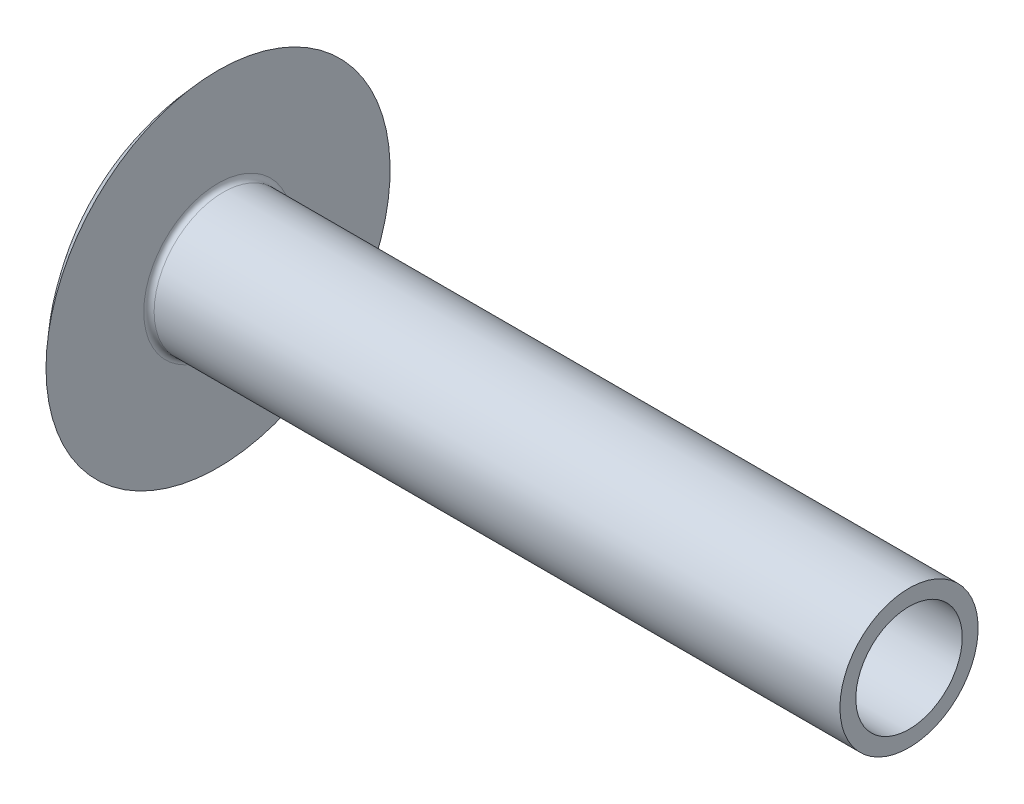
ISO-10303-21;
HEADER;
FILE_DESCRIPTION(('STEP AP214'),'2;1');
FILE_NAME('part.step','',(''),(''),'','','');
FILE_SCHEMA(('AUTOMOTIVE_DESIGN { 1 0 10303 214 1 1 1 1 }'));
ENDSEC;
DATA;
#1=APPLICATION_CONTEXT('core data for automotive mechanical design processes');
#2=APPLICATION_PROTOCOL_DEFINITION('international standard','automotive_design',2000,#1);
#3=PRODUCT_CONTEXT('',#1,'mechanical');
#4=PRODUCT('Part','Part','',(#3));
#5=PRODUCT_RELATED_PRODUCT_CATEGORY('part','',(#4));
#6=PRODUCT_DEFINITION_FORMATION('','',#4);
#7=PRODUCT_DEFINITION_CONTEXT('part definition',#1,'design');
#8=PRODUCT_DEFINITION('design','',#6,#7);
#9=PRODUCT_DEFINITION_SHAPE('','',#8);
#10=(LENGTH_UNIT() NAMED_UNIT(*) SI_UNIT(.MILLI.,.METRE.));
#11=(NAMED_UNIT(*) PLANE_ANGLE_UNIT() SI_UNIT($,.RADIAN.));
#12=(NAMED_UNIT(*) SI_UNIT($,.STERADIAN.) SOLID_ANGLE_UNIT());
#13=UNCERTAINTY_MEASURE_WITH_UNIT(LENGTH_MEASURE(1.E-05),#10,'distance_accuracy_value','');
#14=(GEOMETRIC_REPRESENTATION_CONTEXT(3) GLOBAL_UNCERTAINTY_ASSIGNED_CONTEXT((#13)) GLOBAL_UNIT_ASSIGNED_CONTEXT((#10,
#11,#12)) REPRESENTATION_CONTEXT('',''));
#15=CARTESIAN_POINT('',(0.,0.,0.));
#16=DIRECTION('',(0.,0.,1.));
#17=DIRECTION('',(1.,0.,0.));
#18=AXIS2_PLACEMENT_3D('',#15,#16,#17);
#19=CARTESIAN_POINT('',(43.9620495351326,0.,0.));
#20=DIRECTION('',(-1.,0.,0.));
#21=DIRECTION('',(0.,0.,1.));
#22=AXIS2_PLACEMENT_3D('',#19,#20,#21);
#23=PLANE('',#22);
#24=CARTESIAN_POINT('',(43.9620495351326,0.,0.));
#25=DIRECTION('',(1.,0.,0.));
#26=DIRECTION('',(0.,0.,-1.));
#27=AXIS2_PLACEMENT_3D('',#24,#25,#26);
#28=CIRCLE('',#27,3.08);
#29=CARTESIAN_POINT('',(43.9620495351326,0.,-3.08));
#30=VERTEX_POINT('',#29);
#31=EDGE_CURVE('E53',#30,#30,#28,.T.);
#32=ORIENTED_EDGE('',*,*,#31,.F.);
#33=EDGE_LOOP('',(#32));
#34=FACE_BOUND('',#33,.T.);
#35=CARTESIAN_POINT('',(43.9620495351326,0.,0.));
#36=DIRECTION('',(-1.,0.,0.));
#37=DIRECTION('',(0.,0.,1.));
#38=AXIS2_PLACEMENT_3D('',#35,#36,#37);
#39=CIRCLE('',#38,4.00000000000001);
#40=CARTESIAN_POINT('',(43.9620495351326,0.,4.00000000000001));
#41=VERTEX_POINT('',#40);
#42=EDGE_CURVE('E11',#41,#41,#39,.T.);
#43=ORIENTED_EDGE('',*,*,#42,.F.);
#44=EDGE_LOOP('',(#43));
#45=FACE_BOUND('',#44,.T.);
#46=ADVANCED_FACE('F33',(#34,#45),#23,.F.);
#47=CARTESIAN_POINT('',(-60.0944134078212,0.,0.));
#48=DIRECTION('',(-1.,0.,0.));
#49=DIRECTION('',(0.,0.,1.));
#50=AXIS2_PLACEMENT_3D('',#47,#48,#49);
#51=CYLINDRICAL_SURFACE('',#50,4.);
#52=CARTESIAN_POINT('',(4.26204953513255,0.,0.));
#53=DIRECTION('',(-1.,0.,0.));
#54=DIRECTION('',(0.,0.,1.));
#55=AXIS2_PLACEMENT_3D('',#52,#53,#54);
#56=CIRCLE('',#55,4.);
#57=CARTESIAN_POINT('',(4.26204953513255,0.,4.));
#58=VERTEX_POINT('',#57);
#59=EDGE_CURVE('E39',#58,#58,#56,.T.);
#60=ORIENTED_EDGE('',*,*,#59,.F.);
#61=EDGE_LOOP('',(#60));
#62=FACE_BOUND('',#61,.T.);
#63=ORIENTED_EDGE('',*,*,#42,.T.);
#64=EDGE_LOOP('',(#63));
#65=FACE_BOUND('',#64,.T.);
#66=ADVANCED_FACE('F67',(#62,#65),#51,.T.);
#67=CARTESIAN_POINT('',(4.26204953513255,0.,0.));
#68=DIRECTION('',(-1.,0.,0.));
#69=DIRECTION('',(0.,0.,1.));
#70=AXIS2_PLACEMENT_3D('',#67,#68,#69);
#71=TOROIDAL_SURFACE('',#70,4.3,0.300000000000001);
#72=CARTESIAN_POINT('',(3.96204953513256,0.,0.));
#73=DIRECTION('',(-1.,0.,0.));
#74=DIRECTION('',(0.,0.,1.));
#75=AXIS2_PLACEMENT_3D('',#72,#73,#74);
#76=CIRCLE('',#75,4.3);
#77=CARTESIAN_POINT('',(3.96204953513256,0.,4.3));
#78=VERTEX_POINT('',#77);
#79=EDGE_CURVE('E56',#78,#78,#76,.T.);
#80=ORIENTED_EDGE('',*,*,#79,.F.);
#81=EDGE_LOOP('',(#80));
#82=FACE_BOUND('',#81,.T.);
#83=ORIENTED_EDGE('',*,*,#59,.T.);
#84=EDGE_LOOP('',(#83));
#85=FACE_BOUND('',#84,.T.);
#86=ADVANCED_FACE('F65',(#82,#85),#71,.F.);
#87=CARTESIAN_POINT('',(3.96204953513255,4.3,0.));
#88=DIRECTION('',(-1.,0.,0.));
#89=DIRECTION('',(0.,0.,1.));
#90=AXIS2_PLACEMENT_3D('',#87,#88,#89);
#91=PLANE('',#90);
#92=CARTESIAN_POINT('',(3.96204953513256,0.,0.));
#93=DIRECTION('',(-1.,0.,0.));
#94=DIRECTION('',(0.,0.,1.));
#95=AXIS2_PLACEMENT_3D('',#92,#93,#94);
#96=CIRCLE('',#95,9.96);
#97=CARTESIAN_POINT('',(3.96204953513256,0.,9.96));
#98=VERTEX_POINT('',#97);
#99=EDGE_CURVE('E52',#98,#98,#96,.T.);
#100=ORIENTED_EDGE('',*,*,#99,.F.);
#101=EDGE_LOOP('',(#100));
#102=FACE_BOUND('',#101,.T.);
#103=ORIENTED_EDGE('',*,*,#79,.T.);
#104=EDGE_LOOP('',(#103));
#105=FACE_BOUND('',#104,.T.);
#106=ADVANCED_FACE('F85',(#102,#105),#91,.F.);
#107=CARTESIAN_POINT('',(14.5,0.,0.));
#108=DIRECTION('',(-1.,0.,0.));
#109=DIRECTION('',(0.,1.,0.));
#110=AXIS2_PLACEMENT_3D('',#107,#108,#109);
#111=SPHERICAL_SURFACE('',#110,14.5);
#112=ORIENTED_EDGE('',*,*,#99,.T.);
#113=EDGE_LOOP('',(#112));
#114=FACE_BOUND('',#113,.T.);
#115=ADVANCED_FACE('F46',(#114),#111,.T.);
#116=CARTESIAN_POINT('',(36.3120495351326,0.,0.));
#117=DIRECTION('',(1.,0.,0.));
#118=DIRECTION('',(0.,0.,-1.));
#119=AXIS2_PLACEMENT_3D('',#116,#117,#118);
#120=CONICAL_SURFACE('',#119,3.08,0.942477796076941);
#121=CARTESIAN_POINT('',(34.0742985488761,0.,0.));
#122=VERTEX_POINT('',#121);
#123=VERTEX_LOOP('',#122);
#124=FACE_BOUND('',#123,.T.);
#125=CARTESIAN_POINT('',(36.3120495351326,0.,0.));
#126=DIRECTION('',(1.,0.,0.));
#127=DIRECTION('',(0.,0.,-1.));
#128=AXIS2_PLACEMENT_3D('',#125,#126,#127);
#129=CIRCLE('',#128,3.08);
#130=CARTESIAN_POINT('',(36.3120495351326,0.,-3.08));
#131=VERTEX_POINT('',#130);
#132=EDGE_CURVE('E50',#131,#131,#129,.T.);
#133=ORIENTED_EDGE('',*,*,#132,.T.);
#134=EDGE_LOOP('',(#133));
#135=FACE_BOUND('',#134,.T.);
#136=ADVANCED_FACE('F42',(#124,#135),#120,.F.);
#137=CARTESIAN_POINT('',(2.23767105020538,0.,0.));
#138=DIRECTION('',(1.,0.,0.));
#139=DIRECTION('',(0.,0.,-1.));
#140=AXIS2_PLACEMENT_3D('',#137,#138,#139);
#141=CYLINDRICAL_SURFACE('',#140,3.08);
#142=ORIENTED_EDGE('',*,*,#132,.F.);
#143=EDGE_LOOP('',(#142));
#144=FACE_BOUND('',#143,.T.);
#145=ORIENTED_EDGE('',*,*,#31,.T.);
#146=EDGE_LOOP('',(#145));
#147=FACE_BOUND('',#146,.T.);
#148=ADVANCED_FACE('F45',(#144,#147),#141,.F.);
#149=CLOSED_SHELL('',(#46,#66,#86,#106,#115,#136,#148));
#150=MANIFOLD_SOLID_BREP('B2',#149);
#151=ADVANCED_BREP_SHAPE_REPRESENTATION('',(#18,#150),#14);
#152=SHAPE_DEFINITION_REPRESENTATION(#9,#151);
ENDSEC;
END-ISO-10303-21;
